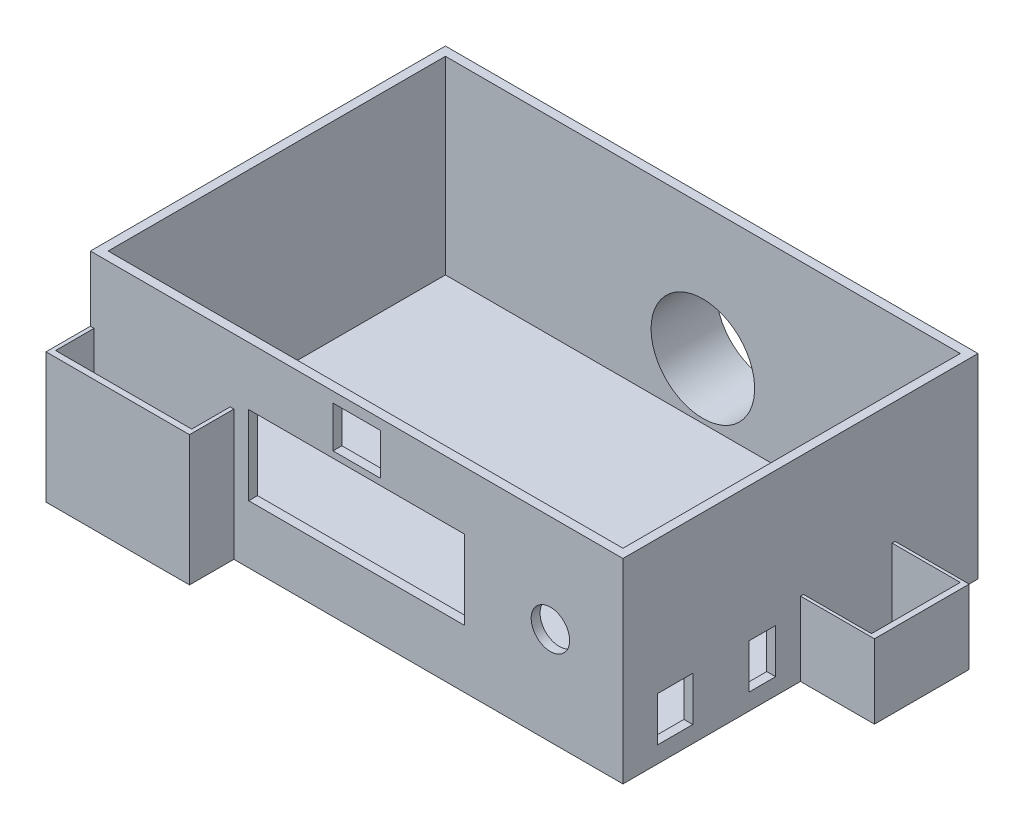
ISO-10303-21;
HEADER;
FILE_DESCRIPTION(('STEP AP214'),'2;1');
FILE_NAME('part.step','',(''),(''),'','','');
FILE_SCHEMA(('AUTOMOTIVE_DESIGN { 1 0 10303 214 1 1 1 1 }'));
ENDSEC;
DATA;
#1=APPLICATION_CONTEXT('core data for automotive mechanical design processes');
#2=APPLICATION_PROTOCOL_DEFINITION('international standard','automotive_design',2000,#1);
#3=PRODUCT_CONTEXT('',#1,'mechanical');
#4=PRODUCT('Part','Part','',(#3));
#5=PRODUCT_RELATED_PRODUCT_CATEGORY('part','',(#4));
#6=PRODUCT_DEFINITION_FORMATION('','',#4);
#7=PRODUCT_DEFINITION_CONTEXT('part definition',#1,'design');
#8=PRODUCT_DEFINITION('design','',#6,#7);
#9=PRODUCT_DEFINITION_SHAPE('','',#8);
#10=(LENGTH_UNIT() NAMED_UNIT(*) SI_UNIT(.MILLI.,.METRE.));
#11=(NAMED_UNIT(*) PLANE_ANGLE_UNIT() SI_UNIT($,.RADIAN.));
#12=(NAMED_UNIT(*) SI_UNIT($,.STERADIAN.) SOLID_ANGLE_UNIT());
#13=UNCERTAINTY_MEASURE_WITH_UNIT(LENGTH_MEASURE(1.E-05),#10,'distance_accuracy_value','');
#14=(GEOMETRIC_REPRESENTATION_CONTEXT(3) GLOBAL_UNCERTAINTY_ASSIGNED_CONTEXT((#13)) GLOBAL_UNIT_ASSIGNED_CONTEXT((#10,
#11,#12)) REPRESENTATION_CONTEXT('',''));
#15=CARTESIAN_POINT('',(0.,0.,0.));
#16=DIRECTION('',(0.,0.,1.));
#17=DIRECTION('',(1.,0.,0.));
#18=AXIS2_PLACEMENT_3D('',#15,#16,#17);
#19=CARTESIAN_POINT('',(-90.,66.,-60.));
#20=DIRECTION('',(0.,0.,1.));
#21=DIRECTION('',(1.,0.,0.));
#22=AXIS2_PLACEMENT_3D('',#19,#20,#21);
#23=PLANE('',#22);
#24=DIRECTION('',(-1.,0.,0.));
#25=VECTOR('',#24,1.);
#26=CARTESIAN_POINT('',(-90.,0.,-60.));
#27=LINE('',#26,#25);
#28=CARTESIAN_POINT('',(90.,0.,-60.));
#29=VERTEX_POINT('',#28);
#30=CARTESIAN_POINT('',(-90.,0.,-60.));
#31=VERTEX_POINT('',#30);
#32=EDGE_CURVE('E580',#29,#31,#27,.T.);
#33=ORIENTED_EDGE('',*,*,#32,.T.);
#34=DIRECTION('',(0.,-1.,0.));
#35=VECTOR('',#34,1.);
#36=CARTESIAN_POINT('',(-90.,66.,-60.));
#37=LINE('',#36,#35);
#38=CARTESIAN_POINT('',(-90.,66.,-60.));
#39=VERTEX_POINT('',#38);
#40=EDGE_CURVE('E590',#39,#31,#37,.T.);
#41=ORIENTED_EDGE('',*,*,#40,.F.);
#42=DIRECTION('',(-1.,0.,0.));
#43=VECTOR('',#42,1.);
#44=CARTESIAN_POINT('',(-90.,66.,-60.));
#45=LINE('',#44,#43);
#46=CARTESIAN_POINT('',(90.,66.,-60.));
#47=VERTEX_POINT('',#46);
#48=EDGE_CURVE('E570',#47,#39,#45,.T.);
#49=ORIENTED_EDGE('',*,*,#48,.F.);
#50=DIRECTION('',(0.,-1.,0.));
#51=VECTOR('',#50,1.);
#52=CARTESIAN_POINT('',(90.,66.,-60.));
#53=LINE('',#52,#51);
#54=EDGE_CURVE('E41',#47,#29,#53,.T.);
#55=ORIENTED_EDGE('',*,*,#54,.T.);
#56=EDGE_LOOP('',(#33,#41,#49,#55));
#57=FACE_BOUND('',#56,.T.);
#58=CARTESIAN_POINT('',(0.,21.,-60.));
#59=DIRECTION('',(0.,0.,1.));
#60=DIRECTION('',(1.,0.,0.));
#61=AXIS2_PLACEMENT_3D('',#58,#59,#60);
#62=CIRCLE('',#61,20.5);
#63=CARTESIAN_POINT('',(20.5,21.,-60.));
#64=VERTEX_POINT('',#63);
#65=EDGE_CURVE('E11',#64,#64,#62,.F.);
#66=ORIENTED_EDGE('',*,*,#65,.F.);
#67=EDGE_LOOP('',(#66));
#68=FACE_BOUND('',#67,.T.);
#69=ADVANCED_FACE('F33',(#57,#68),#23,.F.);
#70=CARTESIAN_POINT('',(-90.,66.,60.));
#71=DIRECTION('',(0.,0.,-1.));
#72=DIRECTION('',(-1.,0.,0.));
#73=AXIS2_PLACEMENT_3D('',#70,#71,#72);
#74=PLANE('',#73);
#75=DIRECTION('',(-1.,0.,0.));
#76=VECTOR('',#75,1.);
#77=CARTESIAN_POINT('',(-8.00000000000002,62.5,60.));
#78=LINE('',#77,#76);
#79=CARTESIAN_POINT('',(7.99999999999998,62.5,60.));
#80=VERTEX_POINT('',#79);
#81=CARTESIAN_POINT('',(-8.00000000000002,62.5,60.));
#82=VERTEX_POINT('',#81);
#83=EDGE_CURVE('E306',#80,#82,#78,.T.);
#84=ORIENTED_EDGE('',*,*,#83,.F.);
#85=DIRECTION('',(0.,1.,0.));
#86=VECTOR('',#85,1.);
#87=CARTESIAN_POINT('',(7.99999999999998,62.5,60.));
#88=LINE('',#87,#86);
#89=CARTESIAN_POINT('',(7.99999999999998,48.5,60.));
#90=VERTEX_POINT('',#89);
#91=EDGE_CURVE('E48',#90,#80,#88,.T.);
#92=ORIENTED_EDGE('',*,*,#91,.F.);
#93=DIRECTION('',(1.,0.,0.));
#94=VECTOR('',#93,1.);
#95=CARTESIAN_POINT('',(-8.00000000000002,48.5,60.));
#96=LINE('',#95,#94);
#97=CARTESIAN_POINT('',(-8.00000000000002,48.5,60.));
#98=VERTEX_POINT('',#97);
#99=EDGE_CURVE('E292',#98,#90,#96,.T.);
#100=ORIENTED_EDGE('',*,*,#99,.F.);
#101=DIRECTION('',(0.,-1.,0.));
#102=VECTOR('',#101,1.);
#103=CARTESIAN_POINT('',(-8.00000000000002,62.5,60.));
#104=LINE('',#103,#102);
#105=EDGE_CURVE('E312',#82,#98,#104,.T.);
#106=ORIENTED_EDGE('',*,*,#105,.F.);
#107=EDGE_LOOP('',(#84,#92,#100,#106));
#108=FACE_BOUND('',#107,.T.);
#109=CARTESIAN_POINT('',(65.4778578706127,33.,60.));
#110=DIRECTION('',(0.,0.,1.));
#111=DIRECTION('',(1.,0.,0.));
#112=AXIS2_PLACEMENT_3D('',#109,#110,#111);
#113=CIRCLE('',#112,6.5);
#114=CARTESIAN_POINT('',(71.9778578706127,33.,60.));
#115=VERTEX_POINT('',#114);
#116=EDGE_CURVE('E468',#115,#115,#113,.T.);
#117=ORIENTED_EDGE('',*,*,#116,.F.);
#118=EDGE_LOOP('',(#117));
#119=FACE_BOUND('',#118,.T.);
#120=DIRECTION('',(-1.,0.,0.));
#121=VECTOR('',#120,1.);
#122=CARTESIAN_POINT('',(-36.5,46.35,60.));
#123=LINE('',#122,#121);
#124=CARTESIAN_POINT('',(36.5,46.35,60.));
#125=VERTEX_POINT('',#124);
#126=CARTESIAN_POINT('',(-36.5,46.35,60.));
#127=VERTEX_POINT('',#126);
#128=EDGE_CURVE('E509',#125,#127,#123,.T.);
#129=ORIENTED_EDGE('',*,*,#128,.F.);
#130=DIRECTION('',(0.,1.,0.));
#131=VECTOR('',#130,1.);
#132=CARTESIAN_POINT('',(36.5,46.35,60.));
#133=LINE('',#132,#131);
#134=CARTESIAN_POINT('',(36.5,19.65,60.));
#135=VERTEX_POINT('',#134);
#136=EDGE_CURVE('E507',#135,#125,#133,.T.);
#137=ORIENTED_EDGE('',*,*,#136,.F.);
#138=DIRECTION('',(1.,0.,0.));
#139=VECTOR('',#138,1.);
#140=CARTESIAN_POINT('',(-36.5,19.65,60.));
#141=LINE('',#140,#139);
#142=CARTESIAN_POINT('',(-36.5,19.65,60.));
#143=VERTEX_POINT('',#142);
#144=EDGE_CURVE('E515',#143,#135,#141,.T.);
#145=ORIENTED_EDGE('',*,*,#144,.F.);
#146=DIRECTION('',(0.,-1.,0.));
#147=VECTOR('',#146,1.);
#148=CARTESIAN_POINT('',(-36.5,46.35,60.));
#149=LINE('',#148,#147);
#150=EDGE_CURVE('E512',#127,#143,#149,.T.);
#151=ORIENTED_EDGE('',*,*,#150,.F.);
#152=EDGE_LOOP('',(#129,#137,#145,#151));
#153=FACE_BOUND('',#152,.T.);
#154=DIRECTION('',(-1.,0.,0.));
#155=VECTOR('',#154,1.);
#156=CARTESIAN_POINT('',(-90.,44.,60.));
#157=LINE('',#156,#155);
#158=CARTESIAN_POINT('',(-41.5,44.,60.));
#159=VERTEX_POINT('',#158);
#160=CARTESIAN_POINT('',(-42.75,44.,60.));
#161=VERTEX_POINT('',#160);
#162=EDGE_CURVE('E354',#159,#161,#157,.T.);
#163=ORIENTED_EDGE('',*,*,#162,.F.);
#164=DIRECTION('',(0.,1.,0.));
#165=VECTOR('',#164,1.);
#166=CARTESIAN_POINT('',(-41.5,44.,60.));
#167=LINE('',#166,#165);
#168=CARTESIAN_POINT('',(-41.5,0.,60.));
#169=VERTEX_POINT('',#168);
#170=EDGE_CURVE('E344',#169,#159,#167,.T.);
#171=ORIENTED_EDGE('',*,*,#170,.F.);
#172=DIRECTION('',(1.,0.,0.));
#173=VECTOR('',#172,1.);
#174=CARTESIAN_POINT('',(-90.,0.,60.));
#175=LINE('',#174,#173);
#176=CARTESIAN_POINT('',(90.,0.,60.));
#177=VERTEX_POINT('',#176);
#178=EDGE_CURVE('E571',#169,#177,#175,.T.);
#179=ORIENTED_EDGE('',*,*,#178,.T.);
#180=DIRECTION('',(0.,-1.,0.));
#181=VECTOR('',#180,1.);
#182=CARTESIAN_POINT('',(90.,66.,60.));
#183=LINE('',#182,#181);
#184=CARTESIAN_POINT('',(90.,66.,60.));
#185=VERTEX_POINT('',#184);
#186=EDGE_CURVE('E577',#185,#177,#183,.T.);
#187=ORIENTED_EDGE('',*,*,#186,.F.);
#188=DIRECTION('',(1.,0.,0.));
#189=VECTOR('',#188,1.);
#190=CARTESIAN_POINT('',(-90.,66.,60.));
#191=LINE('',#190,#189);
#192=CARTESIAN_POINT('',(-90.,66.,60.));
#193=VERTEX_POINT('',#192);
#194=EDGE_CURVE('E575',#193,#185,#191,.T.);
#195=ORIENTED_EDGE('',*,*,#194,.F.);
#196=DIRECTION('',(0.,-1.,0.));
#197=VECTOR('',#196,1.);
#198=CARTESIAN_POINT('',(-90.,66.,60.));
#199=LINE('',#198,#197);
#200=CARTESIAN_POINT('',(-90.,44.,60.));
#201=VERTEX_POINT('',#200);
#202=EDGE_CURVE('E587',#193,#201,#199,.T.);
#203=ORIENTED_EDGE('',*,*,#202,.T.);
#204=CARTESIAN_POINT('',(-88.75,44.,60.));
#205=VERTEX_POINT('',#204);
#206=EDGE_CURVE('E364',#205,#201,#157,.T.);
#207=ORIENTED_EDGE('',*,*,#206,.F.);
#208=DIRECTION('',(0.,1.,0.));
#209=VECTOR('',#208,1.);
#210=CARTESIAN_POINT('',(-88.75,1.99999999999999,60.));
#211=LINE('',#210,#209);
#212=CARTESIAN_POINT('',(-88.75,1.99999999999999,60.));
#213=VERTEX_POINT('',#212);
#214=EDGE_CURVE('E334',#213,#205,#211,.T.);
#215=ORIENTED_EDGE('',*,*,#214,.F.);
#216=DIRECTION('',(-1.,0.,0.));
#217=VECTOR('',#216,1.);
#218=CARTESIAN_POINT('',(-42.75,1.99999999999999,60.));
#219=LINE('',#218,#217);
#220=CARTESIAN_POINT('',(-42.75,1.99999999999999,60.));
#221=VERTEX_POINT('',#220);
#222=EDGE_CURVE('E321',#221,#213,#219,.T.);
#223=ORIENTED_EDGE('',*,*,#222,.F.);
#224=DIRECTION('',(0.,1.,0.));
#225=VECTOR('',#224,1.);
#226=CARTESIAN_POINT('',(-42.75,1.99999999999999,60.));
#227=LINE('',#226,#225);
#228=EDGE_CURVE('E342',#221,#161,#227,.T.);
#229=ORIENTED_EDGE('',*,*,#228,.T.);
#230=EDGE_LOOP('',(#163,#171,#179,#187,#195,#203,#207,#215,#223,#229));
#231=FACE_BOUND('',#230,.T.);
#232=ADVANCED_FACE('F625',(#108,#119,#153,#231),#74,.F.);
#233=CARTESIAN_POINT('',(90.,66.,-60.));
#234=DIRECTION('',(-1.,0.,0.));
#235=DIRECTION('',(0.,0.,1.));
#236=AXIS2_PLACEMENT_3D('',#233,#234,#235);
#237=PLANE('',#236);
#238=DIRECTION('',(0.,0.,1.));
#239=VECTOR('',#238,1.);
#240=CARTESIAN_POINT('',(90.,20.6,17.4));
#241=LINE('',#240,#239);
#242=CARTESIAN_POINT('',(90.,20.6,8.40000000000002));
#243=VERTEX_POINT('',#242);
#244=CARTESIAN_POINT('',(90.,20.6,17.4));
#245=VERTEX_POINT('',#244);
#246=EDGE_CURVE('E478',#243,#245,#241,.T.);
#247=ORIENTED_EDGE('',*,*,#246,.F.);
#248=DIRECTION('',(0.,1.,0.));
#249=VECTOR('',#248,1.);
#250=CARTESIAN_POINT('',(90.,20.6,8.40000000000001));
#251=LINE('',#250,#249);
#252=CARTESIAN_POINT('',(90.,5.6,8.40000000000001));
#253=VERTEX_POINT('',#252);
#254=EDGE_CURVE('E476',#253,#243,#251,.T.);
#255=ORIENTED_EDGE('',*,*,#254,.F.);
#256=DIRECTION('',(0.,0.,-1.));
#257=VECTOR('',#256,1.);
#258=CARTESIAN_POINT('',(90.,5.6,17.4));
#259=LINE('',#258,#257);
#260=CARTESIAN_POINT('',(90.,5.6,17.4));
#261=VERTEX_POINT('',#260);
#262=EDGE_CURVE('E484',#261,#253,#259,.T.);
#263=ORIENTED_EDGE('',*,*,#262,.F.);
#264=DIRECTION('',(0.,-1.,0.));
#265=VECTOR('',#264,1.);
#266=CARTESIAN_POINT('',(90.,20.6,17.4));
#267=LINE('',#266,#265);
#268=EDGE_CURVE('E481',#245,#261,#267,.T.);
#269=ORIENTED_EDGE('',*,*,#268,.F.);
#270=EDGE_LOOP('',(#247,#255,#263,#269));
#271=FACE_BOUND('',#270,.T.);
#272=DIRECTION('',(0.,0.,1.));
#273=VECTOR('',#272,1.);
#274=CARTESIAN_POINT('',(90.,20.6,48.4));
#275=LINE('',#274,#273);
#276=CARTESIAN_POINT('',(90.,20.6,36.4));
#277=VERTEX_POINT('',#276);
#278=CARTESIAN_POINT('',(90.,20.6,48.4));
#279=VERTEX_POINT('',#278);
#280=EDGE_CURVE('E447',#277,#279,#275,.T.);
#281=ORIENTED_EDGE('',*,*,#280,.F.);
#282=DIRECTION('',(0.,1.,0.));
#283=VECTOR('',#282,1.);
#284=CARTESIAN_POINT('',(90.,20.6,36.4));
#285=LINE('',#284,#283);
#286=CARTESIAN_POINT('',(90.,5.6,36.4));
#287=VERTEX_POINT('',#286);
#288=EDGE_CURVE('E445',#287,#277,#285,.T.);
#289=ORIENTED_EDGE('',*,*,#288,.F.);
#290=DIRECTION('',(0.,0.,-1.));
#291=VECTOR('',#290,1.);
#292=CARTESIAN_POINT('',(90.,5.6,48.4));
#293=LINE('',#292,#291);
#294=CARTESIAN_POINT('',(90.,5.6,48.4));
#295=VERTEX_POINT('',#294);
#296=EDGE_CURVE('E453',#295,#287,#293,.T.);
#297=ORIENTED_EDGE('',*,*,#296,.F.);
#298=DIRECTION('',(0.,-1.,0.));
#299=VECTOR('',#298,1.);
#300=CARTESIAN_POINT('',(90.,20.6,48.4));
#301=LINE('',#300,#299);
#302=EDGE_CURVE('E450',#279,#295,#301,.T.);
#303=ORIENTED_EDGE('',*,*,#302,.F.);
#304=EDGE_LOOP('',(#281,#289,#297,#303));
#305=FACE_BOUND('',#304,.T.);
#306=DIRECTION('',(0.,1.,0.));
#307=VECTOR('',#306,1.);
#308=CARTESIAN_POINT('',(90.,25.,-32.));
#309=LINE('',#308,#307);
#310=CARTESIAN_POINT('',(90.,0.,-32.));
#311=VERTEX_POINT('',#310);
#312=CARTESIAN_POINT('',(90.,25.,-32.));
#313=VERTEX_POINT('',#312);
#314=EDGE_CURVE('E399',#311,#313,#309,.T.);
#315=ORIENTED_EDGE('',*,*,#314,.F.);
#316=DIRECTION('',(0.,0.,-1.));
#317=VECTOR('',#316,1.);
#318=CARTESIAN_POINT('',(90.,0.,-60.));
#319=LINE('',#318,#317);
#320=EDGE_CURVE('E560',#311,#29,#319,.T.);
#321=ORIENTED_EDGE('',*,*,#320,.T.);
#322=ORIENTED_EDGE('',*,*,#54,.F.);
#323=DIRECTION('',(0.,0.,-1.));
#324=VECTOR('',#323,1.);
#325=CARTESIAN_POINT('',(90.,66.,-60.));
#326=LINE('',#325,#324);
#327=EDGE_CURVE('E567',#185,#47,#326,.T.);
#328=ORIENTED_EDGE('',*,*,#327,.F.);
#329=ORIENTED_EDGE('',*,*,#186,.T.);
#330=CARTESIAN_POINT('',(90.,0.,0.));
#331=VERTEX_POINT('',#330);
#332=EDGE_CURVE('E578',#177,#331,#319,.T.);
#333=ORIENTED_EDGE('',*,*,#332,.T.);
#334=DIRECTION('',(0.,-1.,0.));
#335=VECTOR('',#334,1.);
#336=CARTESIAN_POINT('',(90.,25.,0.));
#337=LINE('',#336,#335);
#338=CARTESIAN_POINT('',(90.,25.,0.));
#339=VERTEX_POINT('',#338);
#340=EDGE_CURVE('E409',#339,#331,#337,.T.);
#341=ORIENTED_EDGE('',*,*,#340,.F.);
#342=DIRECTION('',(0.,0.,1.));
#343=VECTOR('',#342,1.);
#344=CARTESIAN_POINT('',(90.,25.,0.));
#345=LINE('',#344,#343);
#346=CARTESIAN_POINT('',(90.,25.,-0.999999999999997));
#347=VERTEX_POINT('',#346);
#348=EDGE_CURVE('E418',#347,#339,#345,.T.);
#349=ORIENTED_EDGE('',*,*,#348,.F.);
#350=DIRECTION('',(0.,1.,0.));
#351=VECTOR('',#350,1.);
#352=CARTESIAN_POINT('',(90.,2.,-1.));
#353=LINE('',#352,#351);
#354=CARTESIAN_POINT('',(90.,2.,-1.));
#355=VERTEX_POINT('',#354);
#356=EDGE_CURVE('E389',#355,#347,#353,.T.);
#357=ORIENTED_EDGE('',*,*,#356,.F.);
#358=DIRECTION('',(0.,0.,1.));
#359=VECTOR('',#358,1.);
#360=CARTESIAN_POINT('',(90.,2.,-31.));
#361=LINE('',#360,#359);
#362=CARTESIAN_POINT('',(90.,2.,-31.));
#363=VERTEX_POINT('',#362);
#364=EDGE_CURVE('E376',#363,#355,#361,.T.);
#365=ORIENTED_EDGE('',*,*,#364,.F.);
#366=DIRECTION('',(0.,1.,0.));
#367=VECTOR('',#366,1.);
#368=CARTESIAN_POINT('',(90.,2.,-31.));
#369=LINE('',#368,#367);
#370=CARTESIAN_POINT('',(90.,25.,-31.));
#371=VERTEX_POINT('',#370);
#372=EDGE_CURVE('E397',#363,#371,#369,.T.);
#373=ORIENTED_EDGE('',*,*,#372,.T.);
#374=EDGE_CURVE('E419',#313,#371,#345,.T.);
#375=ORIENTED_EDGE('',*,*,#374,.F.);
#376=EDGE_LOOP('',(#315,#321,#322,#328,#329,#333,#341,#349,#357,#365,#373,#375));
#377=FACE_BOUND('',#376,.T.);
#378=ADVANCED_FACE('F35',(#271,#305,#377),#237,.F.);
#379=CARTESIAN_POINT('',(-90.,66.,-60.));
#380=DIRECTION('',(1.,0.,0.));
#381=DIRECTION('',(0.,0.,-1.));
#382=AXIS2_PLACEMENT_3D('',#379,#380,#381);
#383=PLANE('',#382);
#384=DIRECTION('',(0.,0.,1.));
#385=VECTOR('',#384,1.);
#386=CARTESIAN_POINT('',(-90.,0.,-60.));
#387=LINE('',#386,#385);
#388=CARTESIAN_POINT('',(-90.,0.,75.));
#389=VERTEX_POINT('',#388);
#390=EDGE_CURVE('E582',#31,#389,#387,.T.);
#391=ORIENTED_EDGE('',*,*,#390,.T.);
#392=DIRECTION('',(0.,-1.,0.));
#393=VECTOR('',#392,1.);
#394=CARTESIAN_POINT('',(-90.,0.,75.));
#395=LINE('',#394,#393);
#396=CARTESIAN_POINT('',(-90.,44.,75.));
#397=VERTEX_POINT('',#396);
#398=EDGE_CURVE('E358',#397,#389,#395,.T.);
#399=ORIENTED_EDGE('',*,*,#398,.F.);
#400=DIRECTION('',(0.,0.,-1.));
#401=VECTOR('',#400,1.);
#402=CARTESIAN_POINT('',(-90.,44.,75.));
#403=LINE('',#402,#401);
#404=EDGE_CURVE('E361',#397,#201,#403,.T.);
#405=ORIENTED_EDGE('',*,*,#404,.T.);
#406=ORIENTED_EDGE('',*,*,#202,.F.);
#407=DIRECTION('',(0.,0.,1.));
#408=VECTOR('',#407,1.);
#409=CARTESIAN_POINT('',(-90.,66.,-60.));
#410=LINE('',#409,#408);
#411=EDGE_CURVE('E573',#39,#193,#410,.T.);
#412=ORIENTED_EDGE('',*,*,#411,.F.);
#413=ORIENTED_EDGE('',*,*,#40,.T.);
#414=EDGE_LOOP('',(#391,#399,#405,#406,#412,#413));
#415=FACE_BOUND('',#414,.T.);
#416=ADVANCED_FACE('F610',(#415),#383,.F.);
#417=CARTESIAN_POINT('',(0.,66.,0.));
#418=DIRECTION('',(0.,1.,0.));
#419=DIRECTION('',(0.,0.,1.));
#420=AXIS2_PLACEMENT_3D('',#417,#418,#419);
#421=PLANE('',#420);
#422=DIRECTION('',(0.,0.,-1.));
#423=VECTOR('',#422,1.);
#424=CARTESIAN_POINT('',(87.,66.,-57.));
#425=LINE('',#424,#423);
#426=CARTESIAN_POINT('',(87.,66.,57.));
#427=VERTEX_POINT('',#426);
#428=CARTESIAN_POINT('',(87.,66.,-57.));
#429=VERTEX_POINT('',#428);
#430=EDGE_CURVE('E530',#427,#429,#425,.T.);
#431=ORIENTED_EDGE('',*,*,#430,.F.);
#432=DIRECTION('',(1.,0.,0.));
#433=VECTOR('',#432,1.);
#434=CARTESIAN_POINT('',(-87.,66.,57.));
#435=LINE('',#434,#433);
#436=CARTESIAN_POINT('',(-87.,66.,57.));
#437=VERTEX_POINT('',#436);
#438=EDGE_CURVE('E539',#437,#427,#435,.T.);
#439=ORIENTED_EDGE('',*,*,#438,.F.);
#440=DIRECTION('',(0.,0.,1.));
#441=VECTOR('',#440,1.);
#442=CARTESIAN_POINT('',(-87.,66.,-57.));
#443=LINE('',#442,#441);
#444=CARTESIAN_POINT('',(-87.,66.,-57.));
#445=VERTEX_POINT('',#444);
#446=EDGE_CURVE('E553',#445,#437,#443,.T.);
#447=ORIENTED_EDGE('',*,*,#446,.F.);
#448=DIRECTION('',(-1.,0.,0.));
#449=VECTOR('',#448,1.);
#450=CARTESIAN_POINT('',(-87.,66.,-57.));
#451=LINE('',#450,#449);
#452=EDGE_CURVE('E550',#429,#445,#451,.T.);
#453=ORIENTED_EDGE('',*,*,#452,.F.);
#454=EDGE_LOOP('',(#431,#439,#447,#453));
#455=FACE_BOUND('',#454,.T.);
#456=ORIENTED_EDGE('',*,*,#327,.T.);
#457=ORIENTED_EDGE('',*,*,#48,.T.);
#458=ORIENTED_EDGE('',*,*,#411,.T.);
#459=ORIENTED_EDGE('',*,*,#194,.T.);
#460=EDGE_LOOP('',(#456,#457,#458,#459));
#461=FACE_BOUND('',#460,.T.);
#462=ADVANCED_FACE('F627',(#455,#461),#421,.T.);
#463=CARTESIAN_POINT('',(0.,0.,0.));
#464=DIRECTION('',(0.,1.,0.));
#465=DIRECTION('',(0.,0.,1.));
#466=AXIS2_PLACEMENT_3D('',#463,#464,#465);
#467=PLANE('',#466);
#468=ORIENTED_EDGE('',*,*,#332,.F.);
#469=ORIENTED_EDGE('',*,*,#178,.F.);
#470=DIRECTION('',(0.,0.,-1.));
#471=VECTOR('',#470,1.);
#472=CARTESIAN_POINT('',(-41.5,0.,75.));
#473=LINE('',#472,#471);
#474=CARTESIAN_POINT('',(-41.5,0.,75.));
#475=VERTEX_POINT('',#474);
#476=EDGE_CURVE('E372',#475,#169,#473,.T.);
#477=ORIENTED_EDGE('',*,*,#476,.F.);
#478=DIRECTION('',(1.,0.,0.));
#479=VECTOR('',#478,1.);
#480=CARTESIAN_POINT('',(-41.5,0.,75.));
#481=LINE('',#480,#479);
#482=EDGE_CURVE('E350',#389,#475,#481,.T.);
#483=ORIENTED_EDGE('',*,*,#482,.F.);
#484=ORIENTED_EDGE('',*,*,#390,.F.);
#485=ORIENTED_EDGE('',*,*,#32,.F.);
#486=ORIENTED_EDGE('',*,*,#320,.F.);
#487=DIRECTION('',(-1.,0.,0.));
#488=VECTOR('',#487,1.);
#489=CARTESIAN_POINT('',(115.,0.,-32.));
#490=LINE('',#489,#488);
#491=CARTESIAN_POINT('',(115.,0.,-32.));
#492=VERTEX_POINT('',#491);
#493=EDGE_CURVE('E415',#492,#311,#490,.T.);
#494=ORIENTED_EDGE('',*,*,#493,.F.);
#495=DIRECTION('',(0.,0.,-1.));
#496=VECTOR('',#495,1.);
#497=CARTESIAN_POINT('',(115.,0.,0.));
#498=LINE('',#497,#496);
#499=CARTESIAN_POINT('',(115.,0.,0.));
#500=VERTEX_POINT('',#499);
#501=EDGE_CURVE('E413',#500,#492,#498,.T.);
#502=ORIENTED_EDGE('',*,*,#501,.F.);
#503=DIRECTION('',(-1.,0.,0.));
#504=VECTOR('',#503,1.);
#505=CARTESIAN_POINT('',(115.,0.,0.));
#506=LINE('',#505,#504);
#507=EDGE_CURVE('E426',#500,#331,#506,.T.);
#508=ORIENTED_EDGE('',*,*,#507,.T.);
#509=EDGE_LOOP('',(#468,#469,#477,#483,#484,#485,#486,#494,#502,#508));
#510=FACE_BOUND('',#509,.T.);
#511=ADVANCED_FACE('F605',(#510),#467,.F.);
#512=CARTESIAN_POINT('',(87.,2.,-57.));
#513=DIRECTION('',(1.,0.,0.));
#514=DIRECTION('',(0.,0.,-1.));
#515=AXIS2_PLACEMENT_3D('',#512,#513,#514);
#516=PLANE('',#515);
#517=DIRECTION('',(0.,0.,1.));
#518=VECTOR('',#517,1.);
#519=CARTESIAN_POINT('',(87.,5.6,48.4));
#520=LINE('',#519,#518);
#521=CARTESIAN_POINT('',(87.,5.6,36.4));
#522=VERTEX_POINT('',#521);
#523=CARTESIAN_POINT('',(87.,5.6,48.4));
#524=VERTEX_POINT('',#523);
#525=EDGE_CURVE('E438',#522,#524,#520,.T.);
#526=ORIENTED_EDGE('',*,*,#525,.F.);
#527=DIRECTION('',(0.,-1.,0.));
#528=VECTOR('',#527,1.);
#529=CARTESIAN_POINT('',(87.,20.6,36.4));
#530=LINE('',#529,#528);
#531=CARTESIAN_POINT('',(87.,20.6,36.4));
#532=VERTEX_POINT('',#531);
#533=EDGE_CURVE('E442',#532,#522,#530,.T.);
#534=ORIENTED_EDGE('',*,*,#533,.F.);
#535=DIRECTION('',(0.,0.,-1.));
#536=VECTOR('',#535,1.);
#537=CARTESIAN_POINT('',(87.,20.6,48.4));
#538=LINE('',#537,#536);
#539=CARTESIAN_POINT('',(87.,20.6,48.4));
#540=VERTEX_POINT('',#539);
#541=EDGE_CURVE('E459',#540,#532,#538,.T.);
#542=ORIENTED_EDGE('',*,*,#541,.F.);
#543=DIRECTION('',(0.,1.,0.));
#544=VECTOR('',#543,1.);
#545=CARTESIAN_POINT('',(87.,20.6,48.4));
#546=LINE('',#545,#544);
#547=EDGE_CURVE('E436',#524,#540,#546,.T.);
#548=ORIENTED_EDGE('',*,*,#547,.F.);
#549=EDGE_LOOP('',(#526,#534,#542,#548));
#550=FACE_BOUND('',#549,.T.);
#551=DIRECTION('',(0.,0.,1.));
#552=VECTOR('',#551,1.);
#553=CARTESIAN_POINT('',(87.,5.6,17.4));
#554=LINE('',#553,#552);
#555=CARTESIAN_POINT('',(87.,5.6,8.40000000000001));
#556=VERTEX_POINT('',#555);
#557=CARTESIAN_POINT('',(87.,5.6,17.4));
#558=VERTEX_POINT('',#557);
#559=EDGE_CURVE('E470',#556,#558,#554,.T.);
#560=ORIENTED_EDGE('',*,*,#559,.F.);
#561=DIRECTION('',(0.,-1.,0.));
#562=VECTOR('',#561,1.);
#563=CARTESIAN_POINT('',(87.,20.6,8.40000000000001));
#564=LINE('',#563,#562);
#565=CARTESIAN_POINT('',(87.,20.6,8.40000000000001));
#566=VERTEX_POINT('',#565);
#567=EDGE_CURVE('E473',#566,#556,#564,.T.);
#568=ORIENTED_EDGE('',*,*,#567,.F.);
#569=DIRECTION('',(0.,0.,-1.));
#570=VECTOR('',#569,1.);
#571=CARTESIAN_POINT('',(87.,20.6,17.4));
#572=LINE('',#571,#570);
#573=CARTESIAN_POINT('',(87.,20.6,17.4));
#574=VERTEX_POINT('',#573);
#575=EDGE_CURVE('E439',#574,#566,#572,.T.);
#576=ORIENTED_EDGE('',*,*,#575,.F.);
#577=DIRECTION('',(0.,1.,0.));
#578=VECTOR('',#577,1.);
#579=CARTESIAN_POINT('',(87.,20.6,17.4));
#580=LINE('',#579,#578);
#581=EDGE_CURVE('E435',#558,#574,#580,.T.);
#582=ORIENTED_EDGE('',*,*,#581,.F.);
#583=EDGE_LOOP('',(#560,#568,#576,#582));
#584=FACE_BOUND('',#583,.T.);
#585=ORIENTED_EDGE('',*,*,#430,.T.);
#586=DIRECTION('',(0.,1.,0.));
#587=VECTOR('',#586,1.);
#588=CARTESIAN_POINT('',(87.,2.,-57.));
#589=LINE('',#588,#587);
#590=CARTESIAN_POINT('',(87.,2.,-57.));
#591=VERTEX_POINT('',#590);
#592=EDGE_CURVE('E548',#591,#429,#589,.T.);
#593=ORIENTED_EDGE('',*,*,#592,.F.);
#594=DIRECTION('',(0.,0.,-1.));
#595=VECTOR('',#594,1.);
#596=CARTESIAN_POINT('',(87.,2.,-57.));
#597=LINE('',#596,#595);
#598=CARTESIAN_POINT('',(87.,2.,57.));
#599=VERTEX_POINT('',#598);
#600=EDGE_CURVE('E535',#599,#591,#597,.T.);
#601=ORIENTED_EDGE('',*,*,#600,.F.);
#602=DIRECTION('',(0.,1.,0.));
#603=VECTOR('',#602,1.);
#604=CARTESIAN_POINT('',(87.,2.,57.));
#605=LINE('',#604,#603);
#606=EDGE_CURVE('E558',#599,#427,#605,.T.);
#607=ORIENTED_EDGE('',*,*,#606,.T.);
#608=EDGE_LOOP('',(#585,#593,#601,#607));
#609=FACE_BOUND('',#608,.T.);
#610=ADVANCED_FACE('F635',(#550,#584,#609),#516,.F.);
#611=CARTESIAN_POINT('',(-87.,2.,57.));
#612=DIRECTION('',(0.,0.,1.));
#613=DIRECTION('',(1.,0.,0.));
#614=AXIS2_PLACEMENT_3D('',#611,#612,#613);
#615=PLANE('',#614);
#616=DIRECTION('',(-1.,0.,0.));
#617=VECTOR('',#616,1.);
#618=CARTESIAN_POINT('',(-8.00000000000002,48.5,57.));
#619=LINE('',#618,#617);
#620=CARTESIAN_POINT('',(7.99999999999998,48.5,57.));
#621=VERTEX_POINT('',#620);
#622=CARTESIAN_POINT('',(-8.00000000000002,48.5,57.));
#623=VERTEX_POINT('',#622);
#624=EDGE_CURVE('E304',#621,#623,#619,.T.);
#625=ORIENTED_EDGE('',*,*,#624,.F.);
#626=DIRECTION('',(0.,-1.,0.));
#627=VECTOR('',#626,1.);
#628=CARTESIAN_POINT('',(7.99999999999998,62.5,57.));
#629=LINE('',#628,#627);
#630=CARTESIAN_POINT('',(7.99999999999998,62.5,57.));
#631=VERTEX_POINT('',#630);
#632=EDGE_CURVE('E286',#631,#621,#629,.T.);
#633=ORIENTED_EDGE('',*,*,#632,.F.);
#634=DIRECTION('',(1.,0.,0.));
#635=VECTOR('',#634,1.);
#636=CARTESIAN_POINT('',(-8.00000000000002,62.5,57.));
#637=LINE('',#636,#635);
#638=CARTESIAN_POINT('',(-8.00000000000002,62.5,57.));
#639=VERTEX_POINT('',#638);
#640=EDGE_CURVE('E295',#639,#631,#637,.T.);
#641=ORIENTED_EDGE('',*,*,#640,.F.);
#642=DIRECTION('',(0.,1.,0.));
#643=VECTOR('',#642,1.);
#644=CARTESIAN_POINT('',(-8.00000000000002,62.5,57.));
#645=LINE('',#644,#643);
#646=EDGE_CURVE('E56',#623,#639,#645,.T.);
#647=ORIENTED_EDGE('',*,*,#646,.F.);
#648=EDGE_LOOP('',(#625,#633,#641,#647));
#649=FACE_BOUND('',#648,.T.);
#650=DIRECTION('',(-1.,0.,0.));
#651=VECTOR('',#650,1.);
#652=CARTESIAN_POINT('',(-36.5,19.65,57.));
#653=LINE('',#652,#651);
#654=CARTESIAN_POINT('',(36.5,19.65,57.));
#655=VERTEX_POINT('',#654);
#656=CARTESIAN_POINT('',(-36.5,19.65,57.));
#657=VERTEX_POINT('',#656);
#658=EDGE_CURVE('E500',#655,#657,#653,.T.);
#659=ORIENTED_EDGE('',*,*,#658,.F.);
#660=DIRECTION('',(0.,-1.,0.));
#661=VECTOR('',#660,1.);
#662=CARTESIAN_POINT('',(36.5,46.35,57.));
#663=LINE('',#662,#661);
#664=CARTESIAN_POINT('',(36.5,46.35,57.));
#665=VERTEX_POINT('',#664);
#666=EDGE_CURVE('E504',#665,#655,#663,.T.);
#667=ORIENTED_EDGE('',*,*,#666,.F.);
#668=DIRECTION('',(1.,0.,0.));
#669=VECTOR('',#668,1.);
#670=CARTESIAN_POINT('',(-36.5,46.35,57.));
#671=LINE('',#670,#669);
#672=CARTESIAN_POINT('',(-36.5,46.35,57.));
#673=VERTEX_POINT('',#672);
#674=EDGE_CURVE('E521',#673,#665,#671,.T.);
#675=ORIENTED_EDGE('',*,*,#674,.F.);
#676=DIRECTION('',(0.,1.,0.));
#677=VECTOR('',#676,1.);
#678=CARTESIAN_POINT('',(-36.5,46.35,57.));
#679=LINE('',#678,#677);
#680=EDGE_CURVE('E498',#657,#673,#679,.T.);
#681=ORIENTED_EDGE('',*,*,#680,.F.);
#682=EDGE_LOOP('',(#659,#667,#675,#681));
#683=FACE_BOUND('',#682,.T.);
#684=CARTESIAN_POINT('',(65.4778578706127,33.,57.));
#685=DIRECTION('',(0.,0.,1.));
#686=DIRECTION('',(1.,0.,0.));
#687=AXIS2_PLACEMENT_3D('',#684,#685,#686);
#688=CIRCLE('',#687,6.5);
#689=CARTESIAN_POINT('',(71.9778578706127,33.,57.));
#690=VERTEX_POINT('',#689);
#691=EDGE_CURVE('E501',#690,#690,#688,.F.);
#692=ORIENTED_EDGE('',*,*,#691,.F.);
#693=EDGE_LOOP('',(#692));
#694=FACE_BOUND('',#693,.T.);
#695=ORIENTED_EDGE('',*,*,#438,.T.);
#696=ORIENTED_EDGE('',*,*,#606,.F.);
#697=DIRECTION('',(1.,0.,0.));
#698=VECTOR('',#697,1.);
#699=CARTESIAN_POINT('',(-87.,2.,57.));
#700=LINE('',#699,#698);
#701=CARTESIAN_POINT('',(-87.,2.,57.));
#702=VERTEX_POINT('',#701);
#703=EDGE_CURVE('E545',#702,#599,#700,.T.);
#704=ORIENTED_EDGE('',*,*,#703,.F.);
#705=DIRECTION('',(0.,1.,0.));
#706=VECTOR('',#705,1.);
#707=CARTESIAN_POINT('',(-87.,2.,57.));
#708=LINE('',#707,#706);
#709=EDGE_CURVE('E561',#702,#437,#708,.T.);
#710=ORIENTED_EDGE('',*,*,#709,.T.);
#711=EDGE_LOOP('',(#695,#696,#704,#710));
#712=FACE_BOUND('',#711,.T.);
#713=ADVANCED_FACE('F301',(#649,#683,#694,#712),#615,.F.);
#714=CARTESIAN_POINT('',(-87.,2.,-57.));
#715=DIRECTION('',(-1.,0.,0.));
#716=DIRECTION('',(0.,0.,1.));
#717=AXIS2_PLACEMENT_3D('',#714,#715,#716);
#718=PLANE('',#717);
#719=ORIENTED_EDGE('',*,*,#446,.T.);
#720=ORIENTED_EDGE('',*,*,#709,.F.);
#721=DIRECTION('',(0.,0.,1.));
#722=VECTOR('',#721,1.);
#723=CARTESIAN_POINT('',(-87.,2.,-57.));
#724=LINE('',#723,#722);
#725=CARTESIAN_POINT('',(-87.,2.,-57.));
#726=VERTEX_POINT('',#725);
#727=EDGE_CURVE('E542',#726,#702,#724,.T.);
#728=ORIENTED_EDGE('',*,*,#727,.F.);
#729=DIRECTION('',(0.,1.,0.));
#730=VECTOR('',#729,1.);
#731=CARTESIAN_POINT('',(-87.,2.,-57.));
#732=LINE('',#731,#730);
#733=EDGE_CURVE('E563',#726,#445,#732,.T.);
#734=ORIENTED_EDGE('',*,*,#733,.T.);
#735=EDGE_LOOP('',(#719,#720,#728,#734));
#736=FACE_BOUND('',#735,.T.);
#737=ADVANCED_FACE('F673',(#736),#718,.F.);
#738=CARTESIAN_POINT('',(-87.,2.,-57.));
#739=DIRECTION('',(0.,0.,-1.));
#740=DIRECTION('',(-1.,0.,0.));
#741=AXIS2_PLACEMENT_3D('',#738,#739,#740);
#742=PLANE('',#741);
#743=CARTESIAN_POINT('',(0.,21.,-57.));
#744=DIRECTION('',(0.,0.,-1.));
#745=DIRECTION('',(-1.,0.,0.));
#746=AXIS2_PLACEMENT_3D('',#743,#744,#745);
#747=CIRCLE('',#746,17.5);
#748=CARTESIAN_POINT('',(-17.5,21.,-57.));
#749=VERTEX_POINT('',#748);
#750=EDGE_CURVE('E1090',#749,#749,#747,.T.);
#751=ORIENTED_EDGE('',*,*,#750,.T.);
#752=EDGE_LOOP('',(#751));
#753=FACE_BOUND('',#752,.T.);
#754=ORIENTED_EDGE('',*,*,#452,.T.);
#755=ORIENTED_EDGE('',*,*,#733,.F.);
#756=DIRECTION('',(-1.,0.,0.));
#757=VECTOR('',#756,1.);
#758=CARTESIAN_POINT('',(-87.,2.,-57.));
#759=LINE('',#758,#757);
#760=EDGE_CURVE('E538',#591,#726,#759,.T.);
#761=ORIENTED_EDGE('',*,*,#760,.F.);
#762=ORIENTED_EDGE('',*,*,#592,.T.);
#763=EDGE_LOOP('',(#754,#755,#761,#762));
#764=FACE_BOUND('',#763,.T.);
#765=ADVANCED_FACE('F685',(#753,#764),#742,.F.);
#766=CARTESIAN_POINT('',(0.,2.,0.));
#767=DIRECTION('',(0.,1.,0.));
#768=DIRECTION('',(0.,0.,1.));
#769=AXIS2_PLACEMENT_3D('',#766,#767,#768);
#770=PLANE('',#769);
#771=ORIENTED_EDGE('',*,*,#600,.T.);
#772=ORIENTED_EDGE('',*,*,#760,.T.);
#773=ORIENTED_EDGE('',*,*,#727,.T.);
#774=ORIENTED_EDGE('',*,*,#703,.T.);
#775=EDGE_LOOP('',(#771,#772,#773,#774));
#776=FACE_BOUND('',#775,.T.);
#777=ADVANCED_FACE('F688',(#776),#770,.T.);
#778=CARTESIAN_POINT('',(65.4778578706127,33.,-60.001));
#779=DIRECTION('',(0.,0.,1.));
#780=DIRECTION('',(1.,0.,0.));
#781=AXIS2_PLACEMENT_3D('',#778,#779,#780);
#782=CYLINDRICAL_SURFACE('',#781,6.5);
#783=ORIENTED_EDGE('',*,*,#116,.T.);
#784=EDGE_LOOP('',(#783));
#785=FACE_BOUND('',#784,.T.);
#786=ORIENTED_EDGE('',*,*,#691,.T.);
#787=EDGE_LOOP('',(#786));
#788=FACE_BOUND('',#787,.T.);
#789=ADVANCED_FACE('F767',(#785,#788),#782,.F.);
#790=CARTESIAN_POINT('',(36.5,46.35,-60.001));
#791=DIRECTION('',(1.,0.,0.));
#792=DIRECTION('',(0.,0.,-1.));
#793=AXIS2_PLACEMENT_3D('',#790,#791,#792);
#794=PLANE('',#793);
#795=ORIENTED_EDGE('',*,*,#666,.T.);
#796=DIRECTION('',(0.,0.,1.));
#797=VECTOR('',#796,1.);
#798=CARTESIAN_POINT('',(36.5,19.65,-60.001));
#799=LINE('',#798,#797);
#800=EDGE_CURVE('E519',#655,#135,#799,.T.);
#801=ORIENTED_EDGE('',*,*,#800,.T.);
#802=ORIENTED_EDGE('',*,*,#136,.T.);
#803=DIRECTION('',(0.,0.,1.));
#804=VECTOR('',#803,1.);
#805=CARTESIAN_POINT('',(36.5,46.35,-60.001));
#806=LINE('',#805,#804);
#807=EDGE_CURVE('E518',#665,#125,#806,.T.);
#808=ORIENTED_EDGE('',*,*,#807,.F.);
#809=EDGE_LOOP('',(#795,#801,#802,#808));
#810=FACE_BOUND('',#809,.T.);
#811=ADVANCED_FACE('F664',(#810),#794,.F.);
#812=CARTESIAN_POINT('',(-36.5,19.65,-60.001));
#813=DIRECTION('',(0.,-1.,0.));
#814=DIRECTION('',(0.,0.,-1.));
#815=AXIS2_PLACEMENT_3D('',#812,#813,#814);
#816=PLANE('',#815);
#817=ORIENTED_EDGE('',*,*,#658,.T.);
#818=DIRECTION('',(0.,0.,1.));
#819=VECTOR('',#818,1.);
#820=CARTESIAN_POINT('',(-36.5,19.65,-60.001));
#821=LINE('',#820,#819);
#822=EDGE_CURVE('E522',#657,#143,#821,.T.);
#823=ORIENTED_EDGE('',*,*,#822,.T.);
#824=ORIENTED_EDGE('',*,*,#144,.T.);
#825=ORIENTED_EDGE('',*,*,#800,.F.);
#826=EDGE_LOOP('',(#817,#823,#824,#825));
#827=FACE_BOUND('',#826,.T.);
#828=ADVANCED_FACE('F667',(#827),#816,.F.);
#829=CARTESIAN_POINT('',(-36.5,46.35,-60.001));
#830=DIRECTION('',(-1.,0.,0.));
#831=DIRECTION('',(0.,0.,1.));
#832=AXIS2_PLACEMENT_3D('',#829,#830,#831);
#833=PLANE('',#832);
#834=ORIENTED_EDGE('',*,*,#680,.T.);
#835=DIRECTION('',(0.,0.,1.));
#836=VECTOR('',#835,1.);
#837=CARTESIAN_POINT('',(-36.5,46.35,-60.001));
#838=LINE('',#837,#836);
#839=EDGE_CURVE('E524',#673,#127,#838,.T.);
#840=ORIENTED_EDGE('',*,*,#839,.T.);
#841=ORIENTED_EDGE('',*,*,#150,.T.);
#842=ORIENTED_EDGE('',*,*,#822,.F.);
#843=EDGE_LOOP('',(#834,#840,#841,#842));
#844=FACE_BOUND('',#843,.T.);
#845=ADVANCED_FACE('F670',(#844),#833,.F.);
#846=CARTESIAN_POINT('',(-36.5,46.35,-60.001));
#847=DIRECTION('',(0.,1.,0.));
#848=DIRECTION('',(0.,0.,1.));
#849=AXIS2_PLACEMENT_3D('',#846,#847,#848);
#850=PLANE('',#849);
#851=ORIENTED_EDGE('',*,*,#674,.T.);
#852=ORIENTED_EDGE('',*,*,#807,.T.);
#853=ORIENTED_EDGE('',*,*,#128,.T.);
#854=ORIENTED_EDGE('',*,*,#839,.F.);
#855=EDGE_LOOP('',(#851,#852,#853,#854));
#856=FACE_BOUND('',#855,.T.);
#857=ADVANCED_FACE('F660',(#856),#850,.F.);
#858=CARTESIAN_POINT('',(-90.001,20.6,8.40000000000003));
#859=DIRECTION('',(0.,0.,-1.));
#860=DIRECTION('',(0.,1.,0.));
#861=AXIS2_PLACEMENT_3D('',#858,#859,#860);
#862=PLANE('',#861);
#863=ORIENTED_EDGE('',*,*,#567,.T.);
#864=DIRECTION('',(1.,0.,0.));
#865=VECTOR('',#864,1.);
#866=CARTESIAN_POINT('',(-90.001,5.6,8.40000000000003));
#867=LINE('',#866,#865);
#868=EDGE_CURVE('E488',#556,#253,#867,.T.);
#869=ORIENTED_EDGE('',*,*,#868,.T.);
#870=ORIENTED_EDGE('',*,*,#254,.T.);
#871=DIRECTION('',(1.,0.,0.));
#872=VECTOR('',#871,1.);
#873=CARTESIAN_POINT('',(-90.001,20.6,8.40000000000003));
#874=LINE('',#873,#872);
#875=EDGE_CURVE('E487',#566,#243,#874,.T.);
#876=ORIENTED_EDGE('',*,*,#875,.F.);
#877=EDGE_LOOP('',(#863,#869,#870,#876));
#878=FACE_BOUND('',#877,.T.);
#879=ADVANCED_FACE('F715',(#878),#862,.F.);
#880=CARTESIAN_POINT('',(-90.001,5.6,17.4));
#881=DIRECTION('',(0.,-1.,0.));
#882=DIRECTION('',(0.,0.,-1.));
#883=AXIS2_PLACEMENT_3D('',#880,#881,#882);
#884=PLANE('',#883);
#885=ORIENTED_EDGE('',*,*,#559,.T.);
#886=DIRECTION('',(1.,0.,0.));
#887=VECTOR('',#886,1.);
#888=CARTESIAN_POINT('',(-90.001,5.6,17.4));
#889=LINE('',#888,#887);
#890=EDGE_CURVE('E490',#558,#261,#889,.T.);
#891=ORIENTED_EDGE('',*,*,#890,.T.);
#892=ORIENTED_EDGE('',*,*,#262,.T.);
#893=ORIENTED_EDGE('',*,*,#868,.F.);
#894=EDGE_LOOP('',(#885,#891,#892,#893));
#895=FACE_BOUND('',#894,.T.);
#896=ADVANCED_FACE('F711',(#895),#884,.F.);
#897=CARTESIAN_POINT('',(-90.001,20.6,17.4));
#898=DIRECTION('',(0.,0.,1.));
#899=DIRECTION('',(0.,-1.,0.));
#900=AXIS2_PLACEMENT_3D('',#897,#898,#899);
#901=PLANE('',#900);
#902=ORIENTED_EDGE('',*,*,#581,.T.);
#903=DIRECTION('',(1.,0.,0.));
#904=VECTOR('',#903,1.);
#905=CARTESIAN_POINT('',(-90.001,20.6,17.4));
#906=LINE('',#905,#904);
#907=EDGE_CURVE('E492',#574,#245,#906,.T.);
#908=ORIENTED_EDGE('',*,*,#907,.T.);
#909=ORIENTED_EDGE('',*,*,#268,.T.);
#910=ORIENTED_EDGE('',*,*,#890,.F.);
#911=EDGE_LOOP('',(#902,#908,#909,#910));
#912=FACE_BOUND('',#911,.T.);
#913=ADVANCED_FACE('F722',(#912),#901,.F.);
#914=CARTESIAN_POINT('',(-90.001,20.6,17.4));
#915=DIRECTION('',(0.,1.,0.));
#916=DIRECTION('',(0.,0.,1.));
#917=AXIS2_PLACEMENT_3D('',#914,#915,#916);
#918=PLANE('',#917);
#919=ORIENTED_EDGE('',*,*,#575,.T.);
#920=ORIENTED_EDGE('',*,*,#875,.T.);
#921=ORIENTED_EDGE('',*,*,#246,.T.);
#922=ORIENTED_EDGE('',*,*,#907,.F.);
#923=EDGE_LOOP('',(#919,#920,#921,#922));
#924=FACE_BOUND('',#923,.T.);
#925=ADVANCED_FACE('F719',(#924),#918,.F.);
#926=CARTESIAN_POINT('',(-90.001,20.6,36.4));
#927=DIRECTION('',(0.,0.,-1.));
#928=DIRECTION('',(-1.,0.,0.));
#929=AXIS2_PLACEMENT_3D('',#926,#927,#928);
#930=PLANE('',#929);
#931=ORIENTED_EDGE('',*,*,#533,.T.);
#932=DIRECTION('',(1.,0.,0.));
#933=VECTOR('',#932,1.);
#934=CARTESIAN_POINT('',(-90.001,5.6,36.4));
#935=LINE('',#934,#933);
#936=EDGE_CURVE('E457',#522,#287,#935,.T.);
#937=ORIENTED_EDGE('',*,*,#936,.T.);
#938=ORIENTED_EDGE('',*,*,#288,.T.);
#939=DIRECTION('',(1.,0.,0.));
#940=VECTOR('',#939,1.);
#941=CARTESIAN_POINT('',(-90.001,20.6,36.4));
#942=LINE('',#941,#940);
#943=EDGE_CURVE('E456',#532,#277,#942,.T.);
#944=ORIENTED_EDGE('',*,*,#943,.F.);
#945=EDGE_LOOP('',(#931,#937,#938,#944));
#946=FACE_BOUND('',#945,.T.);
#947=ADVANCED_FACE('F733',(#946),#930,.F.);
#948=CARTESIAN_POINT('',(-90.001,5.6,48.4));
#949=DIRECTION('',(0.,-1.,0.));
#950=DIRECTION('',(0.,0.,-1.));
#951=AXIS2_PLACEMENT_3D('',#948,#949,#950);
#952=PLANE('',#951);
#953=ORIENTED_EDGE('',*,*,#525,.T.);
#954=DIRECTION('',(1.,0.,0.));
#955=VECTOR('',#954,1.);
#956=CARTESIAN_POINT('',(-90.001,5.6,48.4));
#957=LINE('',#956,#955);
#958=EDGE_CURVE('E460',#524,#295,#957,.T.);
#959=ORIENTED_EDGE('',*,*,#958,.T.);
#960=ORIENTED_EDGE('',*,*,#296,.T.);
#961=ORIENTED_EDGE('',*,*,#936,.F.);
#962=EDGE_LOOP('',(#953,#959,#960,#961));
#963=FACE_BOUND('',#962,.T.);
#964=ADVANCED_FACE('F735',(#963),#952,.F.);
#965=CARTESIAN_POINT('',(-90.001,20.6,48.4));
#966=DIRECTION('',(0.,0.,1.));
#967=DIRECTION('',(0.,-1.,0.));
#968=AXIS2_PLACEMENT_3D('',#965,#966,#967);
#969=PLANE('',#968);
#970=ORIENTED_EDGE('',*,*,#547,.T.);
#971=DIRECTION('',(1.,0.,0.));
#972=VECTOR('',#971,1.);
#973=CARTESIAN_POINT('',(-90.001,20.6,48.4));
#974=LINE('',#973,#972);
#975=EDGE_CURVE('E462',#540,#279,#974,.T.);
#976=ORIENTED_EDGE('',*,*,#975,.T.);
#977=ORIENTED_EDGE('',*,*,#302,.T.);
#978=ORIENTED_EDGE('',*,*,#958,.F.);
#979=EDGE_LOOP('',(#970,#976,#977,#978));
#980=FACE_BOUND('',#979,.T.);
#981=ADVANCED_FACE('F737',(#980),#969,.F.);
#982=CARTESIAN_POINT('',(-90.001,20.6,48.4));
#983=DIRECTION('',(0.,1.,0.));
#984=DIRECTION('',(0.,0.,1.));
#985=AXIS2_PLACEMENT_3D('',#982,#983,#984);
#986=PLANE('',#985);
#987=ORIENTED_EDGE('',*,*,#541,.T.);
#988=ORIENTED_EDGE('',*,*,#943,.T.);
#989=ORIENTED_EDGE('',*,*,#280,.T.);
#990=ORIENTED_EDGE('',*,*,#975,.F.);
#991=EDGE_LOOP('',(#987,#988,#989,#990));
#992=FACE_BOUND('',#991,.T.);
#993=ADVANCED_FACE('F730',(#992),#986,.F.);
#994=CARTESIAN_POINT('',(115.,25.,-32.));
#995=DIRECTION('',(0.,0.,1.));
#996=DIRECTION('',(1.,0.,0.));
#997=AXIS2_PLACEMENT_3D('',#994,#995,#996);
#998=PLANE('',#997);
#999=ORIENTED_EDGE('',*,*,#314,.T.);
#1000=DIRECTION('',(-1.,0.,0.));
#1001=VECTOR('',#1000,1.);
#1002=CARTESIAN_POINT('',(115.,25.,-32.));
#1003=LINE('',#1002,#1001);
#1004=CARTESIAN_POINT('',(115.,25.,-32.));
#1005=VERTEX_POINT('',#1004);
#1006=EDGE_CURVE('E432',#1005,#313,#1003,.T.);
#1007=ORIENTED_EDGE('',*,*,#1006,.F.);
#1008=DIRECTION('',(0.,1.,0.));
#1009=VECTOR('',#1008,1.);
#1010=CARTESIAN_POINT('',(115.,25.,-32.));
#1011=LINE('',#1010,#1009);
#1012=EDGE_CURVE('E405',#492,#1005,#1011,.T.);
#1013=ORIENTED_EDGE('',*,*,#1012,.F.);
#1014=ORIENTED_EDGE('',*,*,#493,.T.);
#1015=EDGE_LOOP('',(#999,#1007,#1013,#1014));
#1016=FACE_BOUND('',#1015,.T.);
#1017=ADVANCED_FACE('F744',(#1016),#998,.F.);
#1018=CARTESIAN_POINT('',(115.,25.,0.));
#1019=DIRECTION('',(0.,-1.,0.));
#1020=DIRECTION('',(0.,0.,-1.));
#1021=AXIS2_PLACEMENT_3D('',#1018,#1019,#1020);
#1022=PLANE('',#1021);
#1023=ORIENTED_EDGE('',*,*,#374,.T.);
#1024=DIRECTION('',(-1.,0.,0.));
#1025=VECTOR('',#1024,1.);
#1026=CARTESIAN_POINT('',(113.,25.,-31.));
#1027=LINE('',#1026,#1025);
#1028=CARTESIAN_POINT('',(113.,25.,-31.));
#1029=VERTEX_POINT('',#1028);
#1030=EDGE_CURVE('E380',#1029,#371,#1027,.T.);
#1031=ORIENTED_EDGE('',*,*,#1030,.F.);
#1032=DIRECTION('',(0.,0.,-1.));
#1033=VECTOR('',#1032,1.);
#1034=CARTESIAN_POINT('',(113.,25.,-0.999999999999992));
#1035=LINE('',#1034,#1033);
#1036=CARTESIAN_POINT('',(113.,25.,-0.999999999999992));
#1037=VERTEX_POINT('',#1036);
#1038=EDGE_CURVE('E392',#1037,#1029,#1035,.T.);
#1039=ORIENTED_EDGE('',*,*,#1038,.F.);
#1040=DIRECTION('',(1.,0.,0.));
#1041=VECTOR('',#1040,1.);
#1042=CARTESIAN_POINT('',(90.,25.,-1.));
#1043=LINE('',#1042,#1041);
#1044=EDGE_CURVE('E375',#347,#1037,#1043,.T.);
#1045=ORIENTED_EDGE('',*,*,#1044,.F.);
#1046=ORIENTED_EDGE('',*,*,#348,.T.);
#1047=DIRECTION('',(-1.,0.,0.));
#1048=VECTOR('',#1047,1.);
#1049=CARTESIAN_POINT('',(115.,25.,0.));
#1050=LINE('',#1049,#1048);
#1051=CARTESIAN_POINT('',(115.,25.,0.));
#1052=VERTEX_POINT('',#1051);
#1053=EDGE_CURVE('E429',#1052,#339,#1050,.T.);
#1054=ORIENTED_EDGE('',*,*,#1053,.F.);
#1055=DIRECTION('',(0.,0.,1.));
#1056=VECTOR('',#1055,1.);
#1057=CARTESIAN_POINT('',(115.,25.,0.));
#1058=LINE('',#1057,#1056);
#1059=EDGE_CURVE('E408',#1005,#1052,#1058,.T.);
#1060=ORIENTED_EDGE('',*,*,#1059,.F.);
#1061=ORIENTED_EDGE('',*,*,#1006,.T.);
#1062=EDGE_LOOP('',(#1023,#1031,#1039,#1045,#1046,#1054,#1060,#1061));
#1063=FACE_BOUND('',#1062,.T.);
#1064=ADVANCED_FACE('F839',(#1063),#1022,.F.);
#1065=CARTESIAN_POINT('',(115.,25.,0.));
#1066=DIRECTION('',(0.,0.,-1.));
#1067=DIRECTION('',(0.,1.,0.));
#1068=AXIS2_PLACEMENT_3D('',#1065,#1066,#1067);
#1069=PLANE('',#1068);
#1070=ORIENTED_EDGE('',*,*,#340,.T.);
#1071=ORIENTED_EDGE('',*,*,#507,.F.);
#1072=DIRECTION('',(0.,-1.,0.));
#1073=VECTOR('',#1072,1.);
#1074=CARTESIAN_POINT('',(115.,25.,0.));
#1075=LINE('',#1074,#1073);
#1076=EDGE_CURVE('E411',#1052,#500,#1075,.T.);
#1077=ORIENTED_EDGE('',*,*,#1076,.F.);
#1078=ORIENTED_EDGE('',*,*,#1053,.T.);
#1079=EDGE_LOOP('',(#1070,#1071,#1077,#1078));
#1080=FACE_BOUND('',#1079,.T.);
#1081=ADVANCED_FACE('F847',(#1080),#1069,.F.);
#1082=CARTESIAN_POINT('',(115.,0.,0.));
#1083=DIRECTION('',(1.,0.,0.));
#1084=DIRECTION('',(0.,0.,-1.));
#1085=AXIS2_PLACEMENT_3D('',#1082,#1083,#1084);
#1086=PLANE('',#1085);
#1087=ORIENTED_EDGE('',*,*,#1012,.T.);
#1088=ORIENTED_EDGE('',*,*,#1059,.T.);
#1089=ORIENTED_EDGE('',*,*,#1076,.T.);
#1090=ORIENTED_EDGE('',*,*,#501,.T.);
#1091=EDGE_LOOP('',(#1087,#1088,#1089,#1090));
#1092=FACE_BOUND('',#1091,.T.);
#1093=ADVANCED_FACE('F852',(#1092),#1086,.T.);
#1094=CARTESIAN_POINT('',(113.,2.,-31.));
#1095=DIRECTION('',(0.,0.,-1.));
#1096=DIRECTION('',(-1.,0.,0.));
#1097=AXIS2_PLACEMENT_3D('',#1094,#1095,#1096);
#1098=PLANE('',#1097);
#1099=ORIENTED_EDGE('',*,*,#1030,.T.);
#1100=ORIENTED_EDGE('',*,*,#372,.F.);
#1101=DIRECTION('',(-1.,0.,0.));
#1102=VECTOR('',#1101,1.);
#1103=CARTESIAN_POINT('',(113.,2.,-31.));
#1104=LINE('',#1103,#1102);
#1105=CARTESIAN_POINT('',(113.,2.,-31.));
#1106=VERTEX_POINT('',#1105);
#1107=EDGE_CURVE('E386',#1106,#363,#1104,.T.);
#1108=ORIENTED_EDGE('',*,*,#1107,.F.);
#1109=DIRECTION('',(0.,1.,0.));
#1110=VECTOR('',#1109,1.);
#1111=CARTESIAN_POINT('',(113.,2.,-31.));
#1112=LINE('',#1111,#1110);
#1113=EDGE_CURVE('E400',#1106,#1029,#1112,.T.);
#1114=ORIENTED_EDGE('',*,*,#1113,.T.);
#1115=EDGE_LOOP('',(#1099,#1100,#1108,#1114));
#1116=FACE_BOUND('',#1115,.T.);
#1117=ADVANCED_FACE('F862',(#1116),#1098,.F.);
#1118=CARTESIAN_POINT('',(113.,2.,-0.999999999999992));
#1119=DIRECTION('',(1.,0.,0.));
#1120=DIRECTION('',(0.,0.,-1.));
#1121=AXIS2_PLACEMENT_3D('',#1118,#1119,#1120);
#1122=PLANE('',#1121);
#1123=ORIENTED_EDGE('',*,*,#1038,.T.);
#1124=ORIENTED_EDGE('',*,*,#1113,.F.);
#1125=DIRECTION('',(0.,0.,-1.));
#1126=VECTOR('',#1125,1.);
#1127=CARTESIAN_POINT('',(113.,2.,-0.999999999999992));
#1128=LINE('',#1127,#1126);
#1129=CARTESIAN_POINT('',(113.,2.,-0.999999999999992));
#1130=VERTEX_POINT('',#1129);
#1131=EDGE_CURVE('E383',#1130,#1106,#1128,.T.);
#1132=ORIENTED_EDGE('',*,*,#1131,.F.);
#1133=DIRECTION('',(0.,1.,0.));
#1134=VECTOR('',#1133,1.);
#1135=CARTESIAN_POINT('',(113.,2.,-0.999999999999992));
#1136=LINE('',#1135,#1134);
#1137=EDGE_CURVE('E402',#1130,#1037,#1136,.T.);
#1138=ORIENTED_EDGE('',*,*,#1137,.T.);
#1139=EDGE_LOOP('',(#1123,#1124,#1132,#1138));
#1140=FACE_BOUND('',#1139,.T.);
#1141=ADVANCED_FACE('F885',(#1140),#1122,.F.);
#1142=CARTESIAN_POINT('',(90.,2.,-1.));
#1143=DIRECTION('',(0.,0.,1.));
#1144=DIRECTION('',(1.,0.,0.));
#1145=AXIS2_PLACEMENT_3D('',#1142,#1143,#1144);
#1146=PLANE('',#1145);
#1147=ORIENTED_EDGE('',*,*,#1044,.T.);
#1148=ORIENTED_EDGE('',*,*,#1137,.F.);
#1149=DIRECTION('',(1.,0.,0.));
#1150=VECTOR('',#1149,1.);
#1151=CARTESIAN_POINT('',(90.,2.,-1.));
#1152=LINE('',#1151,#1150);
#1153=EDGE_CURVE('E379',#355,#1130,#1152,.T.);
#1154=ORIENTED_EDGE('',*,*,#1153,.F.);
#1155=ORIENTED_EDGE('',*,*,#356,.T.);
#1156=EDGE_LOOP('',(#1147,#1148,#1154,#1155));
#1157=FACE_BOUND('',#1156,.T.);
#1158=ADVANCED_FACE('F895',(#1157),#1146,.F.);
#1159=CARTESIAN_POINT('',(0.,2.,0.));
#1160=DIRECTION('',(0.,1.,0.));
#1161=DIRECTION('',(0.,0.,1.));
#1162=AXIS2_PLACEMENT_3D('',#1159,#1160,#1161);
#1163=PLANE('',#1162);
#1164=ORIENTED_EDGE('',*,*,#364,.T.);
#1165=ORIENTED_EDGE('',*,*,#1153,.T.);
#1166=ORIENTED_EDGE('',*,*,#1131,.T.);
#1167=ORIENTED_EDGE('',*,*,#1107,.T.);
#1168=EDGE_LOOP('',(#1164,#1165,#1166,#1167));
#1169=FACE_BOUND('',#1168,.T.);
#1170=ADVANCED_FACE('F905',(#1169),#1163,.T.);
#1171=CARTESIAN_POINT('',(-41.5,44.,75.));
#1172=DIRECTION('',(-1.,0.,0.));
#1173=DIRECTION('',(0.,-1.,0.));
#1174=AXIS2_PLACEMENT_3D('',#1171,#1172,#1173);
#1175=PLANE('',#1174);
#1176=ORIENTED_EDGE('',*,*,#170,.T.);
#1177=DIRECTION('',(0.,0.,-1.));
#1178=VECTOR('',#1177,1.);
#1179=CARTESIAN_POINT('',(-41.5,44.,75.));
#1180=LINE('',#1179,#1178);
#1181=CARTESIAN_POINT('',(-41.5,44.,75.));
#1182=VERTEX_POINT('',#1181);
#1183=EDGE_CURVE('E369',#1182,#159,#1180,.T.);
#1184=ORIENTED_EDGE('',*,*,#1183,.F.);
#1185=DIRECTION('',(0.,1.,0.));
#1186=VECTOR('',#1185,1.);
#1187=CARTESIAN_POINT('',(-41.5,44.,75.));
#1188=LINE('',#1187,#1186);
#1189=EDGE_CURVE('E353',#475,#1182,#1188,.T.);
#1190=ORIENTED_EDGE('',*,*,#1189,.F.);
#1191=ORIENTED_EDGE('',*,*,#476,.T.);
#1192=EDGE_LOOP('',(#1176,#1184,#1190,#1191));
#1193=FACE_BOUND('',#1192,.T.);
#1194=ADVANCED_FACE('F915',(#1193),#1175,.F.);
#1195=CARTESIAN_POINT('',(-90.,44.,75.));
#1196=DIRECTION('',(0.,-1.,0.));
#1197=DIRECTION('',(0.,0.,-1.));
#1198=AXIS2_PLACEMENT_3D('',#1195,#1196,#1197);
#1199=PLANE('',#1198);
#1200=ORIENTED_EDGE('',*,*,#162,.T.);
#1201=DIRECTION('',(0.,0.,-1.));
#1202=VECTOR('',#1201,1.);
#1203=CARTESIAN_POINT('',(-42.75,44.,73.));
#1204=LINE('',#1203,#1202);
#1205=CARTESIAN_POINT('',(-42.75,44.,73.));
#1206=VERTEX_POINT('',#1205);
#1207=EDGE_CURVE('E325',#1206,#161,#1204,.T.);
#1208=ORIENTED_EDGE('',*,*,#1207,.F.);
#1209=DIRECTION('',(1.,0.,0.));
#1210=VECTOR('',#1209,1.);
#1211=CARTESIAN_POINT('',(-88.75,44.,73.));
#1212=LINE('',#1211,#1210);
#1213=CARTESIAN_POINT('',(-88.75,44.,73.));
#1214=VERTEX_POINT('',#1213);
#1215=EDGE_CURVE('E337',#1214,#1206,#1212,.T.);
#1216=ORIENTED_EDGE('',*,*,#1215,.F.);
#1217=DIRECTION('',(0.,0.,1.));
#1218=VECTOR('',#1217,1.);
#1219=CARTESIAN_POINT('',(-88.75,44.,60.));
#1220=LINE('',#1219,#1218);
#1221=EDGE_CURVE('E298',#205,#1214,#1220,.T.);
#1222=ORIENTED_EDGE('',*,*,#1221,.F.);
#1223=ORIENTED_EDGE('',*,*,#206,.T.);
#1224=ORIENTED_EDGE('',*,*,#404,.F.);
#1225=DIRECTION('',(-1.,0.,0.));
#1226=VECTOR('',#1225,1.);
#1227=CARTESIAN_POINT('',(-90.,44.,75.));
#1228=LINE('',#1227,#1226);
#1229=EDGE_CURVE('E356',#1182,#397,#1228,.T.);
#1230=ORIENTED_EDGE('',*,*,#1229,.F.);
#1231=ORIENTED_EDGE('',*,*,#1183,.T.);
#1232=EDGE_LOOP('',(#1200,#1208,#1216,#1222,#1223,#1224,#1230,#1231));
#1233=FACE_BOUND('',#1232,.T.);
#1234=ADVANCED_FACE('F618',(#1233),#1199,.F.);
#1235=CARTESIAN_POINT('',(0.,0.,75.));
#1236=DIRECTION('',(0.,0.,-1.));
#1237=DIRECTION('',(-1.,0.,0.));
#1238=AXIS2_PLACEMENT_3D('',#1235,#1236,#1237);
#1239=PLANE('',#1238);
#1240=ORIENTED_EDGE('',*,*,#482,.T.);
#1241=ORIENTED_EDGE('',*,*,#1189,.T.);
#1242=ORIENTED_EDGE('',*,*,#1229,.T.);
#1243=ORIENTED_EDGE('',*,*,#398,.T.);
#1244=EDGE_LOOP('',(#1240,#1241,#1242,#1243));
#1245=FACE_BOUND('',#1244,.T.);
#1246=ADVANCED_FACE('F613',(#1245),#1239,.F.);
#1247=CARTESIAN_POINT('',(-42.75,1.99999999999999,73.));
#1248=DIRECTION('',(1.,0.,0.));
#1249=DIRECTION('',(0.,0.,-1.));
#1250=AXIS2_PLACEMENT_3D('',#1247,#1248,#1249);
#1251=PLANE('',#1250);
#1252=ORIENTED_EDGE('',*,*,#1207,.T.);
#1253=ORIENTED_EDGE('',*,*,#228,.F.);
#1254=DIRECTION('',(0.,0.,-1.));
#1255=VECTOR('',#1254,1.);
#1256=CARTESIAN_POINT('',(-42.75,1.99999999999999,73.));
#1257=LINE('',#1256,#1255);
#1258=CARTESIAN_POINT('',(-42.75,1.99999999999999,73.));
#1259=VERTEX_POINT('',#1258);
#1260=EDGE_CURVE('E331',#1259,#221,#1257,.T.);
#1261=ORIENTED_EDGE('',*,*,#1260,.F.);
#1262=DIRECTION('',(0.,1.,0.));
#1263=VECTOR('',#1262,1.);
#1264=CARTESIAN_POINT('',(-42.75,1.99999999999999,73.));
#1265=LINE('',#1264,#1263);
#1266=EDGE_CURVE('E345',#1259,#1206,#1265,.T.);
#1267=ORIENTED_EDGE('',*,*,#1266,.T.);
#1268=EDGE_LOOP('',(#1252,#1253,#1261,#1267));
#1269=FACE_BOUND('',#1268,.T.);
#1270=ADVANCED_FACE('F950',(#1269),#1251,.F.);
#1271=CARTESIAN_POINT('',(-88.75,1.99999999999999,73.));
#1272=DIRECTION('',(0.,0.,1.));
#1273=DIRECTION('',(1.,0.,0.));
#1274=AXIS2_PLACEMENT_3D('',#1271,#1272,#1273);
#1275=PLANE('',#1274);
#1276=ORIENTED_EDGE('',*,*,#1215,.T.);
#1277=ORIENTED_EDGE('',*,*,#1266,.F.);
#1278=DIRECTION('',(1.,0.,0.));
#1279=VECTOR('',#1278,1.);
#1280=CARTESIAN_POINT('',(-88.75,1.99999999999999,73.));
#1281=LINE('',#1280,#1279);
#1282=CARTESIAN_POINT('',(-88.75,1.99999999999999,73.));
#1283=VERTEX_POINT('',#1282);
#1284=EDGE_CURVE('E328',#1283,#1259,#1281,.T.);
#1285=ORIENTED_EDGE('',*,*,#1284,.F.);
#1286=DIRECTION('',(0.,1.,0.));
#1287=VECTOR('',#1286,1.);
#1288=CARTESIAN_POINT('',(-88.75,1.99999999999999,73.));
#1289=LINE('',#1288,#1287);
#1290=EDGE_CURVE('E347',#1283,#1214,#1289,.T.);
#1291=ORIENTED_EDGE('',*,*,#1290,.T.);
#1292=EDGE_LOOP('',(#1276,#1277,#1285,#1291));
#1293=FACE_BOUND('',#1292,.T.);
#1294=ADVANCED_FACE('F966',(#1293),#1275,.F.);
#1295=CARTESIAN_POINT('',(-88.75,1.99999999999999,60.));
#1296=DIRECTION('',(-1.,0.,0.));
#1297=DIRECTION('',(0.,0.,1.));
#1298=AXIS2_PLACEMENT_3D('',#1295,#1296,#1297);
#1299=PLANE('',#1298);
#1300=ORIENTED_EDGE('',*,*,#1221,.T.);
#1301=ORIENTED_EDGE('',*,*,#1290,.F.);
#1302=DIRECTION('',(0.,0.,1.));
#1303=VECTOR('',#1302,1.);
#1304=CARTESIAN_POINT('',(-88.75,1.99999999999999,60.));
#1305=LINE('',#1304,#1303);
#1306=EDGE_CURVE('E324',#213,#1283,#1305,.T.);
#1307=ORIENTED_EDGE('',*,*,#1306,.F.);
#1308=ORIENTED_EDGE('',*,*,#214,.T.);
#1309=EDGE_LOOP('',(#1300,#1301,#1307,#1308));
#1310=FACE_BOUND('',#1309,.T.);
#1311=ADVANCED_FACE('F976',(#1310),#1299,.F.);
#1312=CARTESIAN_POINT('',(0.,1.99999999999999,0.));
#1313=DIRECTION('',(0.,1.,0.));
#1314=DIRECTION('',(0.,0.,1.));
#1315=AXIS2_PLACEMENT_3D('',#1312,#1313,#1314);
#1316=PLANE('',#1315);
#1317=ORIENTED_EDGE('',*,*,#222,.T.);
#1318=ORIENTED_EDGE('',*,*,#1306,.T.);
#1319=ORIENTED_EDGE('',*,*,#1284,.T.);
#1320=ORIENTED_EDGE('',*,*,#1260,.T.);
#1321=EDGE_LOOP('',(#1317,#1318,#1319,#1320));
#1322=FACE_BOUND('',#1321,.T.);
#1323=ADVANCED_FACE('F986',(#1322),#1316,.T.);
#1324=CARTESIAN_POINT('',(7.99999999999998,62.5,-60.001));
#1325=DIRECTION('',(1.,0.,0.));
#1326=DIRECTION('',(0.,1.,0.));
#1327=AXIS2_PLACEMENT_3D('',#1324,#1325,#1326);
#1328=PLANE('',#1327);
#1329=ORIENTED_EDGE('',*,*,#632,.T.);
#1330=DIRECTION('',(0.,0.,1.));
#1331=VECTOR('',#1330,1.);
#1332=CARTESIAN_POINT('',(7.99999999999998,48.5,-60.001));
#1333=LINE('',#1332,#1331);
#1334=EDGE_CURVE('E299',#621,#90,#1333,.T.);
#1335=ORIENTED_EDGE('',*,*,#1334,.T.);
#1336=ORIENTED_EDGE('',*,*,#91,.T.);
#1337=DIRECTION('',(0.,0.,1.));
#1338=VECTOR('',#1337,1.);
#1339=CARTESIAN_POINT('',(7.99999999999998,62.5,-60.001));
#1340=LINE('',#1339,#1338);
#1341=EDGE_CURVE('E282',#631,#80,#1340,.T.);
#1342=ORIENTED_EDGE('',*,*,#1341,.F.);
#1343=EDGE_LOOP('',(#1329,#1335,#1336,#1342));
#1344=FACE_BOUND('',#1343,.T.);
#1345=ADVANCED_FACE('F284',(#1344),#1328,.F.);
#1346=CARTESIAN_POINT('',(-8.00000000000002,48.5,-60.001));
#1347=DIRECTION('',(0.,-1.,0.));
#1348=DIRECTION('',(0.,0.,-1.));
#1349=AXIS2_PLACEMENT_3D('',#1346,#1347,#1348);
#1350=PLANE('',#1349);
#1351=ORIENTED_EDGE('',*,*,#624,.T.);
#1352=DIRECTION('',(0.,0.,1.));
#1353=VECTOR('',#1352,1.);
#1354=CARTESIAN_POINT('',(-8.00000000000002,48.5,-60.001));
#1355=LINE('',#1354,#1353);
#1356=EDGE_CURVE('E318',#623,#98,#1355,.T.);
#1357=ORIENTED_EDGE('',*,*,#1356,.T.);
#1358=ORIENTED_EDGE('',*,*,#99,.T.);
#1359=ORIENTED_EDGE('',*,*,#1334,.F.);
#1360=EDGE_LOOP('',(#1351,#1357,#1358,#1359));
#1361=FACE_BOUND('',#1360,.T.);
#1362=ADVANCED_FACE('F1016',(#1361),#1350,.F.);
#1363=CARTESIAN_POINT('',(-8.00000000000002,62.5,-60.001));
#1364=DIRECTION('',(-1.,0.,0.));
#1365=DIRECTION('',(0.,-1.,0.));
#1366=AXIS2_PLACEMENT_3D('',#1363,#1364,#1365);
#1367=PLANE('',#1366);
#1368=ORIENTED_EDGE('',*,*,#646,.T.);
#1369=DIRECTION('',(0.,0.,1.));
#1370=VECTOR('',#1369,1.);
#1371=CARTESIAN_POINT('',(-8.00000000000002,62.5,-60.001));
#1372=LINE('',#1371,#1370);
#1373=EDGE_CURVE('E291',#639,#82,#1372,.T.);
#1374=ORIENTED_EDGE('',*,*,#1373,.T.);
#1375=ORIENTED_EDGE('',*,*,#105,.T.);
#1376=ORIENTED_EDGE('',*,*,#1356,.F.);
#1377=EDGE_LOOP('',(#1368,#1374,#1375,#1376));
#1378=FACE_BOUND('',#1377,.T.);
#1379=ADVANCED_FACE('F1025',(#1378),#1367,.F.);
#1380=CARTESIAN_POINT('',(-8.00000000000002,62.5,-60.001));
#1381=DIRECTION('',(0.,1.,0.));
#1382=DIRECTION('',(0.,0.,1.));
#1383=AXIS2_PLACEMENT_3D('',#1380,#1381,#1382);
#1384=PLANE('',#1383);
#1385=ORIENTED_EDGE('',*,*,#640,.T.);
#1386=ORIENTED_EDGE('',*,*,#1341,.T.);
#1387=ORIENTED_EDGE('',*,*,#83,.T.);
#1388=ORIENTED_EDGE('',*,*,#1373,.F.);
#1389=EDGE_LOOP('',(#1385,#1386,#1387,#1388));
#1390=FACE_BOUND('',#1389,.T.);
#1391=ADVANCED_FACE('F296',(#1390),#1384,.F.);
#1392=CARTESIAN_POINT('',(0.,21.,-57.));
#1393=DIRECTION('',(0.,0.,-1.));
#1394=DIRECTION('',(-1.,0.,0.));
#1395=AXIS2_PLACEMENT_3D('',#1392,#1393,#1394);
#1396=CYLINDRICAL_SURFACE('',#1395,17.5);
#1397=ORIENTED_EDGE('',*,*,#750,.F.);
#1398=EDGE_LOOP('',(#1397));
#1399=FACE_BOUND('',#1398,.T.);
#1400=CARTESIAN_POINT('',(0.,21.,-79.));
#1401=DIRECTION('',(0.,0.,-1.));
#1402=DIRECTION('',(-1.,0.,0.));
#1403=AXIS2_PLACEMENT_3D('',#1400,#1401,#1402);
#1404=CIRCLE('',#1403,17.5);
#1405=CARTESIAN_POINT('',(-17.5,21.,-79.));
#1406=VERTEX_POINT('',#1405);
#1407=EDGE_CURVE('E1091',#1406,#1406,#1404,.T.);
#1408=ORIENTED_EDGE('',*,*,#1407,.T.);
#1409=EDGE_LOOP('',(#1408));
#1410=FACE_BOUND('',#1409,.T.);
#1411=ADVANCED_FACE('F1042',(#1399,#1410),#1396,.F.);
#1412=CARTESIAN_POINT('',(0.,21.,-79.));
#1413=DIRECTION('',(0.,0.,-1.));
#1414=DIRECTION('',(-1.,0.,0.));
#1415=AXIS2_PLACEMENT_3D('',#1412,#1413,#1414);
#1416=PLANE('',#1415);
#1417=CARTESIAN_POINT('',(0.,21.,-79.));
#1418=DIRECTION('',(0.,0.,-1.));
#1419=DIRECTION('',(-1.,0.,0.));
#1420=AXIS2_PLACEMENT_3D('',#1417,#1418,#1419);
#1421=CIRCLE('',#1420,20.5);
#1422=CARTESIAN_POINT('',(-20.5,21.,-79.));
#1423=VERTEX_POINT('',#1422);
#1424=EDGE_CURVE('E1088',#1423,#1423,#1421,.T.);
#1425=ORIENTED_EDGE('',*,*,#1424,.T.);
#1426=EDGE_LOOP('',(#1425));
#1427=FACE_BOUND('',#1426,.T.);
#1428=ORIENTED_EDGE('',*,*,#1407,.F.);
#1429=EDGE_LOOP('',(#1428));
#1430=FACE_BOUND('',#1429,.T.);
#1431=ADVANCED_FACE('F1061',(#1427,#1430),#1416,.T.);
#1432=CARTESIAN_POINT('',(0.,21.,-79.));
#1433=DIRECTION('',(0.,0.,1.));
#1434=DIRECTION('',(1.,0.,0.));
#1435=AXIS2_PLACEMENT_3D('',#1432,#1433,#1434);
#1436=CYLINDRICAL_SURFACE('',#1435,20.5);
#1437=ORIENTED_EDGE('',*,*,#1424,.F.);
#1438=EDGE_LOOP('',(#1437));
#1439=FACE_BOUND('',#1438,.T.);
#1440=ORIENTED_EDGE('',*,*,#65,.T.);
#1441=EDGE_LOOP('',(#1440));
#1442=FACE_BOUND('',#1441,.T.);
#1443=ADVANCED_FACE('F1071',(#1439,#1442),#1436,.T.);
#1444=CLOSED_SHELL('',(#69,#232,#378,#416,#462,#511,#610,#713,#737,#765,#777,#789,#811,#828,
#845,#857,#879,#896,#913,#925,#947,#964,#981,#993,#1017,#1064,#1081,#1093,#1117,#1141,#1158,
#1170,#1194,#1234,#1246,#1270,#1294,#1311,#1323,#1345,#1362,#1379,#1391,#1411,#1431,#1443));
#1445=MANIFOLD_SOLID_BREP('B2',#1444);
#1446=ADVANCED_BREP_SHAPE_REPRESENTATION('',(#18,#1445),#14);
#1447=SHAPE_DEFINITION_REPRESENTATION(#9,#1446);
ENDSEC;
END-ISO-10303-21;
